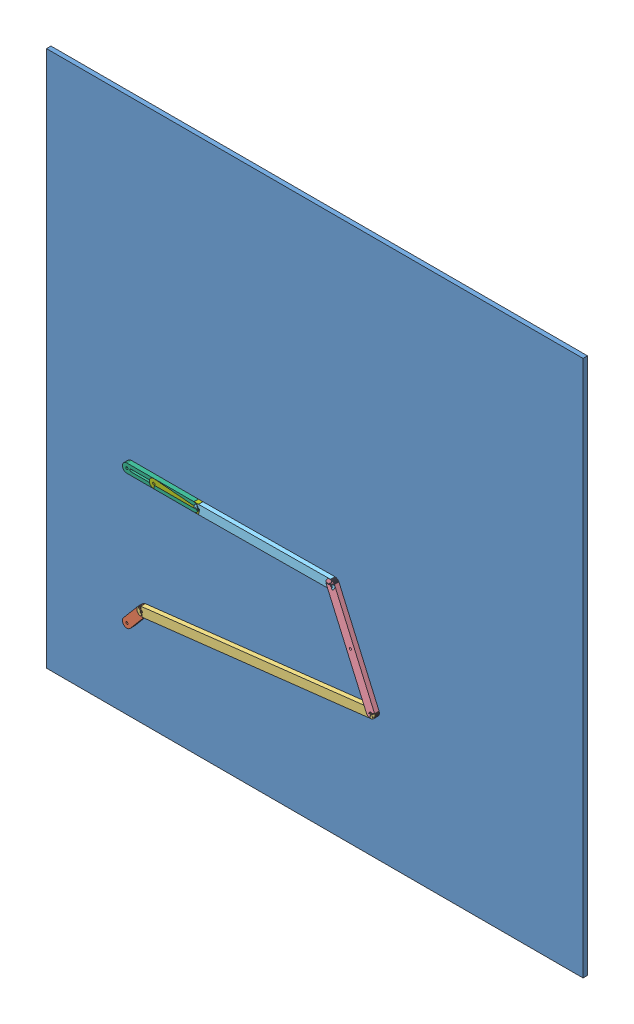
SolidWorks assembly Assem1.SLDASM, configuration Default (file format 11000). Lengths in mm.
Overall size (304.8 304.8 5.08).
7 component instances, 7 part files, 16 mates.
Components (placement in the parent):
- Plate-1: Plate.SLDPRT [Default] at (14.952 95.2999 329.4255) size (304.8 304.8 2.54)
- L1-1: L1.SLDPRT [Default] at (63.157 142.8895 331.9655) x (0.645203 0.764011 0) z (0 0 1) size (17.78 5.08 2.54)
- L2-1: L2.SLDPRT [Default] at (71.351 152.5925 331.9655) x (0.993356 0.115081 0) z (0 0 1) size (136.14 5.08 2.54)
- L3-1: L3.SLDPRT [Default] at (201.5443 167.6755 331.9655) x (-0.401001 0.916078 0) z (0 0 1) size (61.87 5.08 2.54)
- L4-1: L4.SLDPRT [Default] at (103.8422 219.0895 331.9655) x (0.999966 0.008195 0) z (0 0 1) size (80.01 5.08 2.54)
- L5-1: L5.SLDPRT [Default] at (63.157 219.0895 331.9655) size (43.18 5.08 2.54)
- Shaft-1: Shaft.SLDPRT [Default] at (78.4422 219.0895 331.9655) size (30.48 5.08 2.54)
Mates (geometry in assembly coordinates):
- Concentric1: concentric: circle of Plate-1; circle of L1-1
- Concentric2: concentric: circle of L1-1; circle of L2-1
- Concentric3: concentric: circle of L2-1; circle of L3-1
- Concentric4: concentric: circle of Plate-1; circle of L3-1
- Concentric5: concentric: circle of L3-1; circle of L4-1
- Parallel1: parallel: line of Plate-1 through (319.752 400.0999 331.9655) axis (-1 0 0); line of L5-1 through (101.257 221.6295 334.5055) axis (-1 0 0)
- Concentric7: concentric: circle of Plate-1; circle of L5-1
- Coincident2: coincident: plane of Plate-1 through (14.952 95.2999 331.9655) normal (0 0 1); plane of L5-1 through (63.157 219.0895 331.9655) normal (0 0 -1)
- Concentric10: concentric: circle of L4-1; circle of Shaft-1
- Distance4: distance: plane of L1-1 through (63.157 142.8895 331.9655) normal (0 0 -1); plane of Plate-1 through (14.952 95.2999 331.9655) normal (0 0 1)
- Distance5: distance: plane of L2-1 through (71.351 152.5925 331.9655) normal (0 0 -1); plane of Plate-1 through (14.952 95.2999 331.9655) normal (0 0 1)
- Coincident6: coincident: plane of Plate-1 through (14.952 95.2999 331.9655) normal (0 0 1); plane of L3-1 through (201.5443 167.6755 331.9655) normal (0 0 -1)
- Coincident7: coincident: plane of Plate-1 through (14.952 95.2999 331.9655) normal (0 0 1); plane of L4-1 through (103.8422 219.0895 331.9655) normal (0 0 -1)
- Slot3: slot: cylinder of Shaft-1 through (78.4422 219.0895 331.9655) axis (0 0 1) radius 0.635; plane of L5-1 through (65.4569 219.7245 331.9655) normal (0 -1 0); cylinder of L5-1 through (65.4569 219.0895 331.9655) axis (0 0 1) radius 0.635
- Coincident8: coincident: plane of Plate-1 through (14.952 95.2999 331.9655) normal (0 0 1); plane of Shaft-1 through (78.4422 219.0895 331.9655) normal (0 0 -1)
- Angle4: planar angle = 3.141593 rad: line of Shaft-1 through (78.4422 216.5495 334.5055) axis (1 0 0); line of L5-1 through (63.157 216.5495 334.5055) axis (1 0 0)
